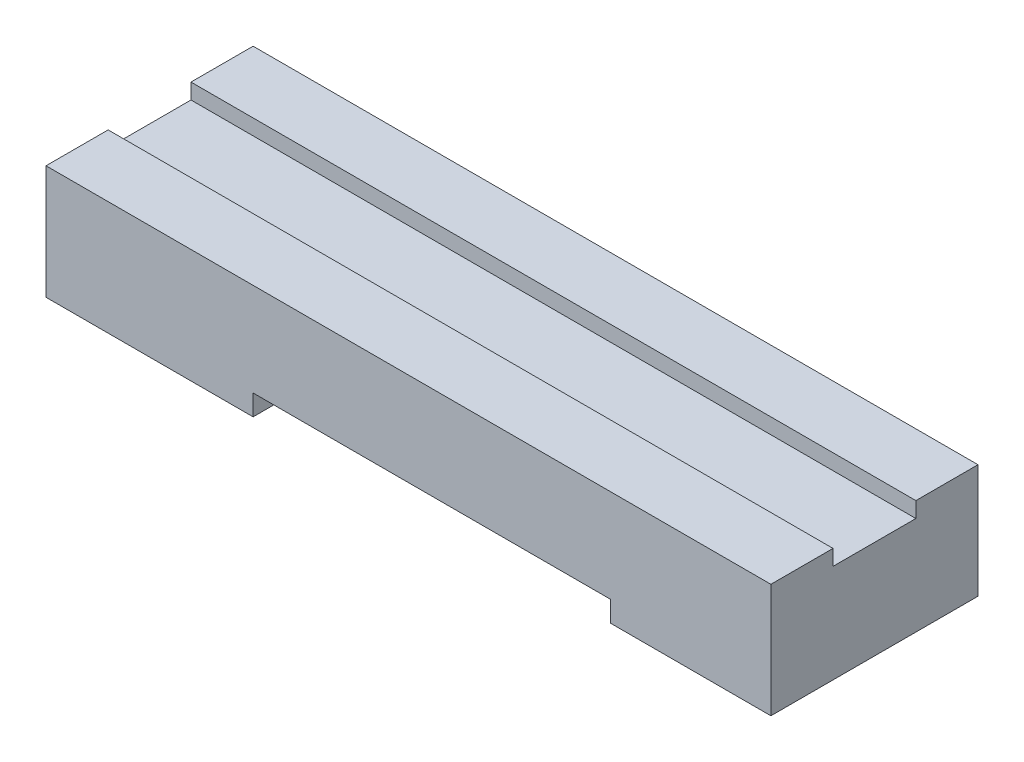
from build123d import *

# Parameters (mm, degrees)
ESQUISSE3_W             = 1400
ESQUISSE3_H             = 220
EXTRUSION2_DEPTH        = 400
ESQUISSE4_W             = 690
ESQUISSE4_H             = 40
ENL_V_MAT_EXTRU_1_DEPTH = 814.695274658
ESQUISSE5_W             = 160
ESQUISSE5_H             = 30
ENL_V_MAT_EXTRU_2_DEPTH = 1461.171222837


with BuildPart() as part:
    # Esquisse3 → Extrusion2 (new body)
    with BuildSketch(Plane.XY):
        Rectangle(ESQUISSE3_W, ESQUISSE3_H)
    extrude(amount=EXTRUSION2_DEPTH)

    # Esquisse4 → Enl_v. mat.-Extru.1 (cut, through all)
    with BuildSketch(Plane.XY.offset(400)):
        with Locations((45, -90)):
            Rectangle(ESQUISSE4_W, ESQUISSE4_H)
    extrude(amount=-ENL_V_MAT_EXTRU_1_DEPTH, mode=Mode.SUBTRACT)

    # Esquisse5 → Enl_v. mat.-Extru.2 (cut, through all)
    with BuildSketch(Plane.ZY.offset(700)):
        with Locations((200, 95)):
            Rectangle(ESQUISSE5_W, ESQUISSE5_H)
    extrude(amount=-ENL_V_MAT_EXTRU_2_DEPTH, mode=Mode.SUBTRACT)


solid = part.part
